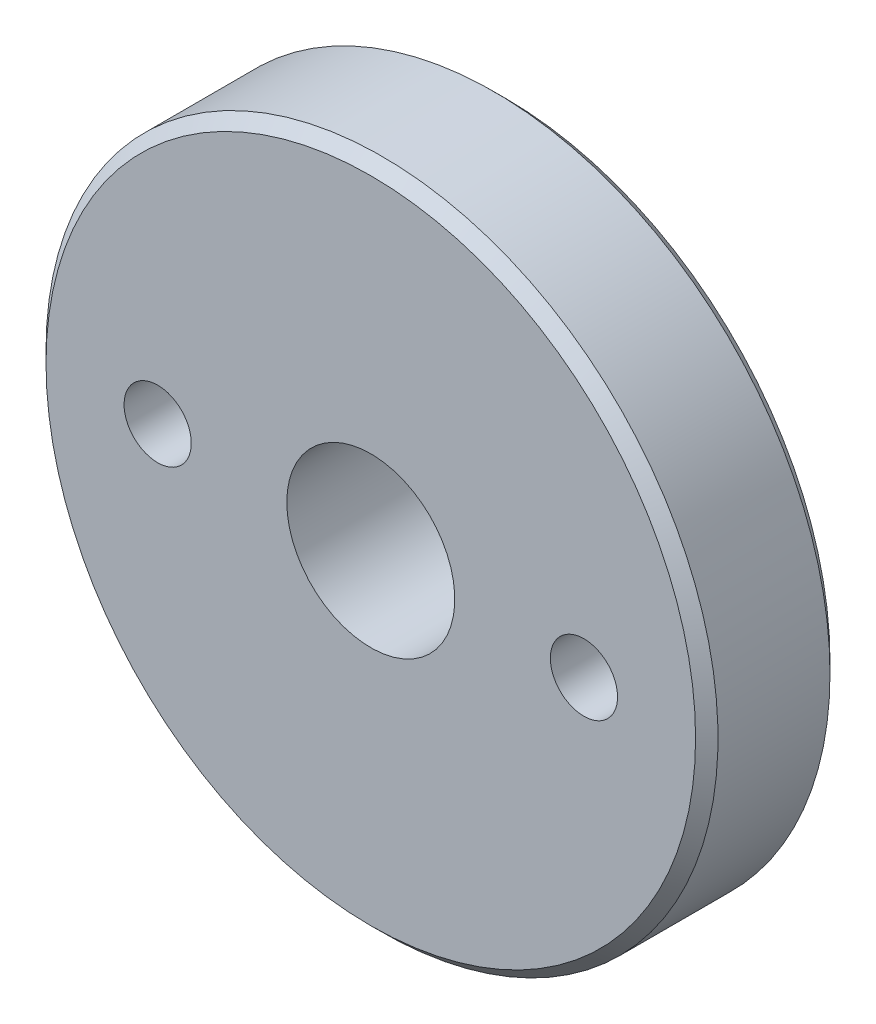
ISO-10303-21;
HEADER;
FILE_DESCRIPTION(('STEP AP214'),'2;1');
FILE_NAME('part.step','',(''),(''),'','','');
FILE_SCHEMA(('AUTOMOTIVE_DESIGN { 1 0 10303 214 1 1 1 1 }'));
ENDSEC;
DATA;
#1=APPLICATION_CONTEXT('core data for automotive mechanical design processes');
#2=APPLICATION_PROTOCOL_DEFINITION('international standard','automotive_design',2000,#1);
#3=PRODUCT_CONTEXT('',#1,'mechanical');
#4=PRODUCT('Part','Part','',(#3));
#5=PRODUCT_RELATED_PRODUCT_CATEGORY('part','',(#4));
#6=PRODUCT_DEFINITION_FORMATION('','',#4);
#7=PRODUCT_DEFINITION_CONTEXT('part definition',#1,'design');
#8=PRODUCT_DEFINITION('design','',#6,#7);
#9=PRODUCT_DEFINITION_SHAPE('','',#8);
#10=(LENGTH_UNIT() NAMED_UNIT(*) SI_UNIT(.MILLI.,.METRE.));
#11=(NAMED_UNIT(*) PLANE_ANGLE_UNIT() SI_UNIT($,.RADIAN.));
#12=(NAMED_UNIT(*) SI_UNIT($,.STERADIAN.) SOLID_ANGLE_UNIT());
#13=UNCERTAINTY_MEASURE_WITH_UNIT(LENGTH_MEASURE(1.E-05),#10,'distance_accuracy_value','');
#14=(GEOMETRIC_REPRESENTATION_CONTEXT(3) GLOBAL_UNCERTAINTY_ASSIGNED_CONTEXT((#13)) GLOBAL_UNIT_ASSIGNED_CONTEXT((#10,
#11,#12)) REPRESENTATION_CONTEXT('',''));
#15=CARTESIAN_POINT('',(0.,0.,0.));
#16=DIRECTION('',(0.,0.,1.));
#17=DIRECTION('',(1.,0.,0.));
#18=AXIS2_PLACEMENT_3D('',#15,#16,#17);
#19=CARTESIAN_POINT('',(0.,0.,19.3705627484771));
#20=DIRECTION('',(0.,0.,-1.));
#21=DIRECTION('',(-1.,0.,0.));
#22=AXIS2_PLACEMENT_3D('',#19,#20,#21);
#23=CYLINDRICAL_SURFACE('',#22,6.);
#24=CARTESIAN_POINT('',(0.,0.,2.2));
#25=DIRECTION('',(0.,0.,1.));
#26=DIRECTION('',(1.,0.,0.));
#27=AXIS2_PLACEMENT_3D('',#24,#25,#26);
#28=CIRCLE('',#27,6.);
#29=CARTESIAN_POINT('',(-6.,0.,2.2));
#30=VERTEX_POINT('',#29);
#31=EDGE_CURVE('E32',#30,#30,#28,.F.);
#32=CARTESIAN_POINT('',(0.,0.,0.199999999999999));
#33=DIRECTION('',(0.,0.,1.));
#34=DIRECTION('',(1.,0.,0.));
#35=AXIS2_PLACEMENT_3D('',#32,#33,#34);
#36=CIRCLE('',#35,6.);
#37=CARTESIAN_POINT('',(-6.,0.,0.199999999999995));
#38=VERTEX_POINT('',#37);
#39=EDGE_CURVE('E68',#38,#38,#36,.T.);
#40=CARTESIAN_POINT('',(-6.,0.,2.2));
#41=CARTESIAN_POINT('',(-6.,0.,2.17916666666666));
#42=CARTESIAN_POINT('',(-6.,0.,2.15833333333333));
#43=CARTESIAN_POINT('',(-6.,0.,2.11666666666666));
#44=CARTESIAN_POINT('',(-6.,0.,2.09583333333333));
#45=CARTESIAN_POINT('',(-6.,0.,2.05416666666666));
#46=CARTESIAN_POINT('',(-6.,0.,2.03333333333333));
#47=CARTESIAN_POINT('',(-6.,0.,1.99166666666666));
#48=CARTESIAN_POINT('',(-6.,0.,1.97083333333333));
#49=CARTESIAN_POINT('',(-6.,0.,1.92916666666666));
#50=CARTESIAN_POINT('',(-6.,0.,1.90833333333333));
#51=CARTESIAN_POINT('',(-6.,0.,1.86666666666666));
#52=CARTESIAN_POINT('',(-6.,0.,1.84583333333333));
#53=CARTESIAN_POINT('',(-6.,0.,1.80416666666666));
#54=CARTESIAN_POINT('',(-6.,0.,1.78333333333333));
#55=CARTESIAN_POINT('',(-6.,0.,1.74166666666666));
#56=CARTESIAN_POINT('',(-6.,0.,1.72083333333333));
#57=CARTESIAN_POINT('',(-6.,0.,1.67916666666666));
#58=CARTESIAN_POINT('',(-6.,0.,1.65833333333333));
#59=CARTESIAN_POINT('',(-6.,0.,1.61666666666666));
#60=CARTESIAN_POINT('',(-6.,0.,1.59583333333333));
#61=CARTESIAN_POINT('',(-6.,0.,1.55416666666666));
#62=CARTESIAN_POINT('',(-6.,0.,1.53333333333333));
#63=CARTESIAN_POINT('',(-6.,0.,1.49166666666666));
#64=CARTESIAN_POINT('',(-6.,0.,1.47083333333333));
#65=CARTESIAN_POINT('',(-6.,0.,1.42916666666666));
#66=CARTESIAN_POINT('',(-6.,0.,1.40833333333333));
#67=CARTESIAN_POINT('',(-6.,0.,1.36666666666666));
#68=CARTESIAN_POINT('',(-6.,0.,1.34583333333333));
#69=CARTESIAN_POINT('',(-6.,0.,1.30416666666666));
#70=CARTESIAN_POINT('',(-6.,0.,1.28333333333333));
#71=CARTESIAN_POINT('',(-6.,0.,1.24166666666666));
#72=CARTESIAN_POINT('',(-6.,0.,1.22083333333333));
#73=CARTESIAN_POINT('',(-6.,0.,1.17916666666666));
#74=CARTESIAN_POINT('',(-6.,0.,1.15833333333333));
#75=CARTESIAN_POINT('',(-6.,0.,1.11666666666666));
#76=CARTESIAN_POINT('',(-6.,0.,1.09583333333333));
#77=CARTESIAN_POINT('',(-6.,0.,1.05416666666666));
#78=CARTESIAN_POINT('',(-6.,0.,1.03333333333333));
#79=CARTESIAN_POINT('',(-6.,0.,0.991666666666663));
#80=CARTESIAN_POINT('',(-6.,0.,0.970833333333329));
#81=CARTESIAN_POINT('',(-6.,0.,0.929166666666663));
#82=CARTESIAN_POINT('',(-6.,0.,0.908333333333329));
#83=CARTESIAN_POINT('',(-6.,0.,0.866666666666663));
#84=CARTESIAN_POINT('',(-6.,0.,0.845833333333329));
#85=CARTESIAN_POINT('',(-6.,0.,0.804166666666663));
#86=CARTESIAN_POINT('',(-6.,0.,0.783333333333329));
#87=CARTESIAN_POINT('',(-6.,0.,0.741666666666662));
#88=CARTESIAN_POINT('',(-6.,0.,0.720833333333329));
#89=CARTESIAN_POINT('',(-6.,0.,0.679166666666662));
#90=CARTESIAN_POINT('',(-6.,0.,0.658333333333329));
#91=CARTESIAN_POINT('',(-6.,0.,0.616666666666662));
#92=CARTESIAN_POINT('',(-6.,0.,0.595833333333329));
#93=CARTESIAN_POINT('',(-6.,0.,0.554166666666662));
#94=CARTESIAN_POINT('',(-6.,0.,0.533333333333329));
#95=CARTESIAN_POINT('',(-6.,0.,0.491666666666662));
#96=CARTESIAN_POINT('',(-6.,0.,0.470833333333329));
#97=CARTESIAN_POINT('',(-6.,0.,0.429166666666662));
#98=CARTESIAN_POINT('',(-6.,0.,0.408333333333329));
#99=CARTESIAN_POINT('',(-6.,0.,0.366666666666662));
#100=CARTESIAN_POINT('',(-6.,0.,0.345833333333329));
#101=CARTESIAN_POINT('',(-6.,0.,0.304166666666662));
#102=CARTESIAN_POINT('',(-6.,0.,0.283333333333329));
#103=CARTESIAN_POINT('',(-6.,0.,0.241666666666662));
#104=CARTESIAN_POINT('',(-6.,0.,0.220833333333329));
#105=CARTESIAN_POINT('',(-6.,0.,0.199999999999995));
#106=B_SPLINE_CURVE_WITH_KNOTS('',3,(#40,#41,#42,#43,#44,#45,#46,#47,#48,#49,#50,#51,#52,#53,
#54,#55,#56,#57,#58,#59,#60,#61,#62,#63,#64,#65,#66,#67,#68,#69,#70,#71,#72,#73,#74,#75,#76,#77,
#78,#79,#80,#81,#82,#83,#84,#85,#86,#87,#88,#89,#90,#91,#92,#93,#94,#95,#96,#97,#98,#99,#100,
#101,#102,#103,#104,#105),.UNSPECIFIED.,.F.,.F.,(4,2,2,2,2,2,2,2,2,2,2,2,2,2,2,2,2,2,2,2,2,2,2,
2,2,2,2,2,2,2,2,2,4),(0.,0.0625000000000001,0.125,0.1875,0.25,0.3125,0.375,0.4375,0.5,0.5625,
0.625000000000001,0.687500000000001,0.750000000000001,0.812500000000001,0.875000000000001,
0.937500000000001,1.,1.0625,1.125,1.1875,1.25,1.3125,1.375,1.4375,1.5,1.5625,1.625,1.6875,1.75,
1.8125,1.875,1.9375,2.),.UNSPECIFIED.);
#107=EDGE_CURVE('BSEAM25',#30,#38,#106,.T.);
#108=ORIENTED_EDGE('',*,*,#31,.T.);
#109=ORIENTED_EDGE('',*,*,#39,.T.);
#110=ORIENTED_EDGE('',*,*,#107,.T.);
#111=ORIENTED_EDGE('',*,*,#107,.F.);
#112=EDGE_LOOP('',(#108,#110,#109,#111));
#113=FACE_BOUND('',#112,.T.);
#114=ADVANCED_FACE('F25',(#113),#23,.T.);
#115=CARTESIAN_POINT('',(0.,0.,0.));
#116=DIRECTION('',(0.,0.,1.));
#117=DIRECTION('',(1.,0.,0.));
#118=AXIS2_PLACEMENT_3D('',#115,#116,#117);
#119=PLANE('',#118);
#120=CARTESIAN_POINT('',(0.,0.,0.));
#121=DIRECTION('',(0.,0.,1.));
#122=DIRECTION('',(1.,0.,0.));
#123=AXIS2_PLACEMENT_3D('',#120,#121,#122);
#124=CIRCLE('',#123,5.8);
#125=CARTESIAN_POINT('',(5.8,0.,0.));
#126=VERTEX_POINT('',#125);
#127=EDGE_CURVE('E11',#126,#126,#124,.F.);
#128=ORIENTED_EDGE('',*,*,#127,.T.);
#129=EDGE_LOOP('',(#128));
#130=FACE_BOUND('',#129,.T.);
#131=CARTESIAN_POINT('',(0.,0.,0.));
#132=DIRECTION('',(0.,0.,1.));
#133=DIRECTION('',(1.,0.,0.));
#134=AXIS2_PLACEMENT_3D('',#131,#132,#133);
#135=CIRCLE('',#134,1.5);
#136=CARTESIAN_POINT('',(-1.5,0.,0.));
#137=VERTEX_POINT('',#136);
#138=EDGE_CURVE('E60',#137,#137,#135,.T.);
#139=ORIENTED_EDGE('',*,*,#138,.T.);
#140=EDGE_LOOP('',(#139));
#141=FACE_BOUND('',#140,.T.);
#142=ADVANCED_FACE('F94',(#130,#141),#119,.F.);
#143=CARTESIAN_POINT('',(0.,0.,19.3705627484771));
#144=DIRECTION('',(0.,0.,-1.));
#145=DIRECTION('',(-1.,0.,0.));
#146=AXIS2_PLACEMENT_3D('',#143,#144,#145);
#147=CYLINDRICAL_SURFACE('',#146,1.5);
#148=CARTESIAN_POINT('',(0.,0.,2.4));
#149=DIRECTION('',(0.,0.,1.));
#150=DIRECTION('',(1.,0.,0.));
#151=AXIS2_PLACEMENT_3D('',#148,#149,#150);
#152=CIRCLE('',#151,1.5);
#153=CARTESIAN_POINT('',(-1.5,0.,2.4));
#154=VERTEX_POINT('',#153);
#155=EDGE_CURVE('E59',#154,#154,#152,.T.);
#156=CARTESIAN_POINT('',(-1.5,0.,0.));
#157=CARTESIAN_POINT('',(-1.5,0.,0.0249999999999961));
#158=CARTESIAN_POINT('',(-1.5,0.,0.0499999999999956));
#159=CARTESIAN_POINT('',(-1.5,0.,0.0999999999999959));
#160=CARTESIAN_POINT('',(-1.5,0.,0.124999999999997));
#161=CARTESIAN_POINT('',(-1.5,0.,0.174999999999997));
#162=CARTESIAN_POINT('',(-1.5,0.,0.199999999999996));
#163=CARTESIAN_POINT('',(-1.5,0.,0.249999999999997));
#164=CARTESIAN_POINT('',(-1.5,0.,0.274999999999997));
#165=CARTESIAN_POINT('',(-1.5,0.,0.324999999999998));
#166=CARTESIAN_POINT('',(-1.5,0.,0.349999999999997));
#167=CARTESIAN_POINT('',(-1.5,0.,0.399999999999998));
#168=CARTESIAN_POINT('',(-1.5,0.,0.424999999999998));
#169=CARTESIAN_POINT('',(-1.5,0.,0.474999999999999));
#170=CARTESIAN_POINT('',(-1.5,0.,0.499999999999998));
#171=CARTESIAN_POINT('',(-1.5,0.,0.549999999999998));
#172=CARTESIAN_POINT('',(-1.5,0.,0.574999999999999));
#173=CARTESIAN_POINT('',(-1.5,0.,0.624999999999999));
#174=CARTESIAN_POINT('',(-1.5,0.,0.649999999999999));
#175=CARTESIAN_POINT('',(-1.5,0.,0.699999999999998));
#176=CARTESIAN_POINT('',(-1.5,0.,0.724999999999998));
#177=CARTESIAN_POINT('',(-1.5,0.,0.774999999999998));
#178=CARTESIAN_POINT('',(-1.5,0.,0.799999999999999));
#179=CARTESIAN_POINT('',(-1.5,0.,0.849999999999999));
#180=CARTESIAN_POINT('',(-1.5,0.,0.874999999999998));
#181=CARTESIAN_POINT('',(-1.5,0.,0.924999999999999));
#182=CARTESIAN_POINT('',(-1.5,0.,0.95));
#183=CARTESIAN_POINT('',(-1.5,0.,1.));
#184=CARTESIAN_POINT('',(-1.5,0.,1.025));
#185=CARTESIAN_POINT('',(-1.5,0.,1.075));
#186=CARTESIAN_POINT('',(-1.5,0.,1.1));
#187=CARTESIAN_POINT('',(-1.5,0.,1.15));
#188=CARTESIAN_POINT('',(-1.5,0.,1.175));
#189=CARTESIAN_POINT('',(-1.5,0.,1.225));
#190=CARTESIAN_POINT('',(-1.5,0.,1.25));
#191=CARTESIAN_POINT('',(-1.5,0.,1.3));
#192=CARTESIAN_POINT('',(-1.5,0.,1.325));
#193=CARTESIAN_POINT('',(-1.5,0.,1.375));
#194=CARTESIAN_POINT('',(-1.5,0.,1.4));
#195=CARTESIAN_POINT('',(-1.5,0.,1.45));
#196=CARTESIAN_POINT('',(-1.5,0.,1.475));
#197=CARTESIAN_POINT('',(-1.5,0.,1.525));
#198=CARTESIAN_POINT('',(-1.5,0.,1.55));
#199=CARTESIAN_POINT('',(-1.5,0.,1.6));
#200=CARTESIAN_POINT('',(-1.5,0.,1.625));
#201=CARTESIAN_POINT('',(-1.5,0.,1.675));
#202=CARTESIAN_POINT('',(-1.5,0.,1.7));
#203=CARTESIAN_POINT('',(-1.5,0.,1.75));
#204=CARTESIAN_POINT('',(-1.5,0.,1.775));
#205=CARTESIAN_POINT('',(-1.5,0.,1.825));
#206=CARTESIAN_POINT('',(-1.5,0.,1.85));
#207=CARTESIAN_POINT('',(-1.5,0.,1.9));
#208=CARTESIAN_POINT('',(-1.5,0.,1.925));
#209=CARTESIAN_POINT('',(-1.5,0.,1.975));
#210=CARTESIAN_POINT('',(-1.5,0.,2.));
#211=CARTESIAN_POINT('',(-1.5,0.,2.05));
#212=CARTESIAN_POINT('',(-1.5,0.,2.075));
#213=CARTESIAN_POINT('',(-1.5,0.,2.125));
#214=CARTESIAN_POINT('',(-1.5,0.,2.15));
#215=CARTESIAN_POINT('',(-1.5,0.,2.2));
#216=CARTESIAN_POINT('',(-1.5,0.,2.225));
#217=CARTESIAN_POINT('',(-1.5,0.,2.275));
#218=CARTESIAN_POINT('',(-1.5,0.,2.3));
#219=CARTESIAN_POINT('',(-1.5,0.,2.35));
#220=CARTESIAN_POINT('',(-1.5,0.,2.375));
#221=CARTESIAN_POINT('',(-1.5,0.,2.4));
#222=B_SPLINE_CURVE_WITH_KNOTS('',3,(#156,#157,#158,#159,#160,#161,#162,#163,#164,#165,#166,
#167,#168,#169,#170,#171,#172,#173,#174,#175,#176,#177,#178,#179,#180,#181,#182,#183,#184,#185,
#186,#187,#188,#189,#190,#191,#192,#193,#194,#195,#196,#197,#198,#199,#200,#201,#202,#203,#204,
#205,#206,#207,#208,#209,#210,#211,#212,#213,#214,#215,#216,#217,#218,#219,#220,#221),
.UNSPECIFIED.,.F.,.F.,(4,2,2,2,2,2,2,2,2,2,2,2,2,2,2,2,2,2,2,2,2,2,2,2,2,2,2,2,2,2,2,2,4),(0.,
0.0749999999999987,0.150000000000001,0.225,0.300000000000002,0.375,0.450000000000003,
0.525000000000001,0.600000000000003,0.675000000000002,0.750000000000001,0.825000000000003,
0.900000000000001,0.975000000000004,1.05,1.125,1.2,1.275,1.35,1.425,1.5,1.575,1.65000000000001,
1.725,1.8,1.87500000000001,1.95,2.02500000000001,2.1,2.17500000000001,2.25000000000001,
2.32500000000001,2.40000000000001),.UNSPECIFIED.);
#223=EDGE_CURVE('BSEAM85',#137,#154,#222,.T.);
#224=ORIENTED_EDGE('',*,*,#138,.F.);
#225=ORIENTED_EDGE('',*,*,#155,.T.);
#226=ORIENTED_EDGE('',*,*,#223,.T.);
#227=ORIENTED_EDGE('',*,*,#223,.F.);
#228=EDGE_LOOP('',(#224,#226,#225,#227));
#229=FACE_BOUND('',#228,.T.);
#230=ADVANCED_FACE('F85',(#229),#147,.F.);
#231=CARTESIAN_POINT('',(4.83824408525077,4.34066747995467,2.4));
#232=DIRECTION('',(0.,0.,1.));
#233=DIRECTION('',(0.744345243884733,0.667794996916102,0.));
#234=AXIS2_PLACEMENT_3D('',#231,#232,#233);
#235=PLANE('',#234);
#236=CARTESIAN_POINT('',(0.,0.,2.4));
#237=DIRECTION('',(0.,0.,1.));
#238=DIRECTION('',(1.,0.,0.));
#239=AXIS2_PLACEMENT_3D('',#236,#237,#238);
#240=CIRCLE('',#239,5.8);
#241=CARTESIAN_POINT('',(-5.8,0.,2.4));
#242=VERTEX_POINT('',#241);
#243=EDGE_CURVE('E63',#242,#242,#240,.T.);
#244=ORIENTED_EDGE('',*,*,#243,.T.);
#245=EDGE_LOOP('',(#244));
#246=FACE_BOUND('',#245,.T.);
#247=CARTESIAN_POINT('',(3.80613418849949,-0.0578146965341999,2.4));
#248=DIRECTION('',(0.,0.,1.));
#249=DIRECTION('',(0.,-1.,0.));
#250=AXIS2_PLACEMENT_3D('',#247,#248,#249);
#251=CIRCLE('',#250,0.599999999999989);
#252=CARTESIAN_POINT('',(3.80613418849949,-0.657814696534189,2.4));
#253=VERTEX_POINT('',#252);
#254=EDGE_CURVE('E48',#253,#253,#251,.T.);
#255=ORIENTED_EDGE('',*,*,#254,.F.);
#256=EDGE_LOOP('',(#255));
#257=FACE_BOUND('',#256,.T.);
#258=CARTESIAN_POINT('',(-3.80613418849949,0.0578146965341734,2.4));
#259=DIRECTION('',(0.,0.,1.));
#260=DIRECTION('',(0.,-1.,0.));
#261=AXIS2_PLACEMENT_3D('',#258,#259,#260);
#262=CIRCLE('',#261,0.599999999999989);
#263=CARTESIAN_POINT('',(-3.80613418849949,-0.542185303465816,2.4));
#264=VERTEX_POINT('',#263);
#265=EDGE_CURVE('E56',#264,#264,#262,.T.);
#266=ORIENTED_EDGE('',*,*,#265,.F.);
#267=EDGE_LOOP('',(#266));
#268=FACE_BOUND('',#267,.T.);
#269=ORIENTED_EDGE('',*,*,#155,.F.);
#270=EDGE_LOOP('',(#269));
#271=FACE_BOUND('',#270,.T.);
#272=ADVANCED_FACE('F81',(#246,#257,#268,#271),#235,.T.);
#273=CARTESIAN_POINT('',(-3.80613418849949,0.0578146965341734,2.4));
#274=DIRECTION('',(0.,0.,1.));
#275=DIRECTION('',(0.,-1.,0.));
#276=AXIS2_PLACEMENT_3D('',#273,#274,#275);
#277=CYLINDRICAL_SURFACE('',#276,0.599999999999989);
#278=CARTESIAN_POINT('',(-3.80613418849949,0.0578146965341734,1.4));
#279=DIRECTION('',(0.,0.,1.));
#280=DIRECTION('',(0.,-1.,0.));
#281=AXIS2_PLACEMENT_3D('',#278,#279,#280);
#282=CIRCLE('',#281,0.599999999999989);
#283=CARTESIAN_POINT('',(-3.80613418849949,-0.542185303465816,1.4));
#284=VERTEX_POINT('',#283);
#285=EDGE_CURVE('E51',#284,#284,#282,.T.);
#286=CARTESIAN_POINT('',(-3.80613418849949,-0.542185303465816,1.4));
#287=CARTESIAN_POINT('',(-3.80613418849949,-0.542185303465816,1.41041666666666));
#288=CARTESIAN_POINT('',(-3.80613418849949,-0.542185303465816,1.42083333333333));
#289=CARTESIAN_POINT('',(-3.80613418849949,-0.542185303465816,1.44166666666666));
#290=CARTESIAN_POINT('',(-3.80613418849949,-0.542185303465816,1.45208333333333));
#291=CARTESIAN_POINT('',(-3.80613418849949,-0.542185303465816,1.47291666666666));
#292=CARTESIAN_POINT('',(-3.80613418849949,-0.542185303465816,1.48333333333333));
#293=CARTESIAN_POINT('',(-3.80613418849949,-0.542185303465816,1.50416666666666));
#294=CARTESIAN_POINT('',(-3.80613418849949,-0.542185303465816,1.51458333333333));
#295=CARTESIAN_POINT('',(-3.80613418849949,-0.542185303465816,1.53541666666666));
#296=CARTESIAN_POINT('',(-3.80613418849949,-0.542185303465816,1.54583333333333));
#297=CARTESIAN_POINT('',(-3.80613418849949,-0.542185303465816,1.56666666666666));
#298=CARTESIAN_POINT('',(-3.80613418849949,-0.542185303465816,1.57708333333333));
#299=CARTESIAN_POINT('',(-3.80613418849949,-0.542185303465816,1.59791666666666));
#300=CARTESIAN_POINT('',(-3.80613418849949,-0.542185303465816,1.60833333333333));
#301=CARTESIAN_POINT('',(-3.80613418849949,-0.542185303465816,1.62916666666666));
#302=CARTESIAN_POINT('',(-3.80613418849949,-0.542185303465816,1.63958333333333));
#303=CARTESIAN_POINT('',(-3.80613418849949,-0.542185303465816,1.66041666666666));
#304=CARTESIAN_POINT('',(-3.80613418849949,-0.542185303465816,1.67083333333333));
#305=CARTESIAN_POINT('',(-3.80613418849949,-0.542185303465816,1.69166666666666));
#306=CARTESIAN_POINT('',(-3.80613418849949,-0.542185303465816,1.70208333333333));
#307=CARTESIAN_POINT('',(-3.80613418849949,-0.542185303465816,1.72291666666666));
#308=CARTESIAN_POINT('',(-3.80613418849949,-0.542185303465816,1.73333333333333));
#309=CARTESIAN_POINT('',(-3.80613418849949,-0.542185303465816,1.75416666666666));
#310=CARTESIAN_POINT('',(-3.80613418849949,-0.542185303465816,1.76458333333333));
#311=CARTESIAN_POINT('',(-3.80613418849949,-0.542185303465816,1.78541666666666));
#312=CARTESIAN_POINT('',(-3.80613418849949,-0.542185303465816,1.79583333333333));
#313=CARTESIAN_POINT('',(-3.80613418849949,-0.542185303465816,1.81666666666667));
#314=CARTESIAN_POINT('',(-3.80613418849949,-0.542185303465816,1.82708333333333));
#315=CARTESIAN_POINT('',(-3.80613418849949,-0.542185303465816,1.84791666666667));
#316=CARTESIAN_POINT('',(-3.80613418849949,-0.542185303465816,1.85833333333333));
#317=CARTESIAN_POINT('',(-3.80613418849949,-0.542185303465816,1.87916666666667));
#318=CARTESIAN_POINT('',(-3.80613418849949,-0.542185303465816,1.88958333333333));
#319=CARTESIAN_POINT('',(-3.80613418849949,-0.542185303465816,1.91041666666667));
#320=CARTESIAN_POINT('',(-3.80613418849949,-0.542185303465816,1.92083333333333));
#321=CARTESIAN_POINT('',(-3.80613418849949,-0.542185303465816,1.94166666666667));
#322=CARTESIAN_POINT('',(-3.80613418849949,-0.542185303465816,1.95208333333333));
#323=CARTESIAN_POINT('',(-3.80613418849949,-0.542185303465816,1.97291666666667));
#324=CARTESIAN_POINT('',(-3.80613418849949,-0.542185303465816,1.98333333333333));
#325=CARTESIAN_POINT('',(-3.80613418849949,-0.542185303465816,2.00416666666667));
#326=CARTESIAN_POINT('',(-3.80613418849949,-0.542185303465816,2.01458333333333));
#327=CARTESIAN_POINT('',(-3.80613418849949,-0.542185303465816,2.03541666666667));
#328=CARTESIAN_POINT('',(-3.80613418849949,-0.542185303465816,2.04583333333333));
#329=CARTESIAN_POINT('',(-3.80613418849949,-0.542185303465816,2.06666666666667));
#330=CARTESIAN_POINT('',(-3.80613418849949,-0.542185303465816,2.07708333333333));
#331=CARTESIAN_POINT('',(-3.80613418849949,-0.542185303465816,2.09791666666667));
#332=CARTESIAN_POINT('',(-3.80613418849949,-0.542185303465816,2.10833333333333));
#333=CARTESIAN_POINT('',(-3.80613418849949,-0.542185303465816,2.12916666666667));
#334=CARTESIAN_POINT('',(-3.80613418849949,-0.542185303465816,2.13958333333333));
#335=CARTESIAN_POINT('',(-3.80613418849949,-0.542185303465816,2.16041666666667));
#336=CARTESIAN_POINT('',(-3.80613418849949,-0.542185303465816,2.17083333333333));
#337=CARTESIAN_POINT('',(-3.80613418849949,-0.542185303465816,2.19166666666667));
#338=CARTESIAN_POINT('',(-3.80613418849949,-0.542185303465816,2.20208333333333));
#339=CARTESIAN_POINT('',(-3.80613418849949,-0.542185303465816,2.22291666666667));
#340=CARTESIAN_POINT('',(-3.80613418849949,-0.542185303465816,2.23333333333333));
#341=CARTESIAN_POINT('',(-3.80613418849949,-0.542185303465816,2.25416666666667));
#342=CARTESIAN_POINT('',(-3.80613418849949,-0.542185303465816,2.26458333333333));
#343=CARTESIAN_POINT('',(-3.80613418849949,-0.542185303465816,2.28541666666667));
#344=CARTESIAN_POINT('',(-3.80613418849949,-0.542185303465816,2.29583333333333));
#345=CARTESIAN_POINT('',(-3.80613418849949,-0.542185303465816,2.31666666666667));
#346=CARTESIAN_POINT('',(-3.80613418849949,-0.542185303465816,2.32708333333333));
#347=CARTESIAN_POINT('',(-3.80613418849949,-0.542185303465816,2.34791666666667));
#348=CARTESIAN_POINT('',(-3.80613418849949,-0.542185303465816,2.35833333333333));
#349=CARTESIAN_POINT('',(-3.80613418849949,-0.542185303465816,2.37916666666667));
#350=CARTESIAN_POINT('',(-3.80613418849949,-0.542185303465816,2.38958333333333));
#351=CARTESIAN_POINT('',(-3.80613418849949,-0.542185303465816,2.4));
#352=B_SPLINE_CURVE_WITH_KNOTS('',3,(#286,#287,#288,#289,#290,#291,#292,#293,#294,#295,#296,
#297,#298,#299,#300,#301,#302,#303,#304,#305,#306,#307,#308,#309,#310,#311,#312,#313,#314,#315,
#316,#317,#318,#319,#320,#321,#322,#323,#324,#325,#326,#327,#328,#329,#330,#331,#332,#333,#334,
#335,#336,#337,#338,#339,#340,#341,#342,#343,#344,#345,#346,#347,#348,#349,#350,#351),
.UNSPECIFIED.,.F.,.F.,(4,2,2,2,2,2,2,2,2,2,2,2,2,2,2,2,2,2,2,2,2,2,2,2,2,2,2,2,2,2,2,2,4),(0.,
0.03125,0.0625000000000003,0.0937500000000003,0.125,0.15625,0.1875,0.21875,0.25,0.28125,0.3125,
0.34375,0.375000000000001,0.406250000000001,0.437500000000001,0.468750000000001,
0.500000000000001,0.531250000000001,0.562500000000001,0.593750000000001,0.625000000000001,
0.656250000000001,0.687500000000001,0.718750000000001,0.750000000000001,0.781250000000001,
0.812500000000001,0.843750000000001,0.875000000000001,0.906250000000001,0.937500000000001,
0.968750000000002,1.),.UNSPECIFIED.);
#353=EDGE_CURVE('BSEAM84',#284,#264,#352,.T.);
#354=ORIENTED_EDGE('',*,*,#285,.F.);
#355=ORIENTED_EDGE('',*,*,#265,.T.);
#356=ORIENTED_EDGE('',*,*,#353,.T.);
#357=ORIENTED_EDGE('',*,*,#353,.F.);
#358=EDGE_LOOP('',(#354,#356,#355,#357));
#359=FACE_BOUND('',#358,.T.);
#360=ADVANCED_FACE('F84',(#359),#277,.F.);
#361=CARTESIAN_POINT('',(-3.80613418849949,0.0578146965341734,1.4));
#362=DIRECTION('',(0.,0.,1.));
#363=DIRECTION('',(0.,-1.,0.));
#364=AXIS2_PLACEMENT_3D('',#361,#362,#363);
#365=CONICAL_SURFACE('',#364,0.599999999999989,1.02974425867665);
#366=CARTESIAN_POINT('',(-3.80613418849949,0.0578146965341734,1.03948362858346));
#367=VERTEX_POINT('',#366);
#368=VERTEX_LOOP('',#367);
#369=FACE_BOUND('',#368,.T.);
#370=ORIENTED_EDGE('',*,*,#285,.T.);
#371=EDGE_LOOP('',(#370));
#372=FACE_BOUND('',#371,.T.);
#373=ADVANCED_FACE('F110',(#369,#372),#365,.F.);
#374=CARTESIAN_POINT('',(3.80613418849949,-0.0578146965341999,2.4));
#375=DIRECTION('',(0.,0.,1.));
#376=DIRECTION('',(0.,-1.,0.));
#377=AXIS2_PLACEMENT_3D('',#374,#375,#376);
#378=CYLINDRICAL_SURFACE('',#377,0.599999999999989);
#379=CARTESIAN_POINT('',(3.80613418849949,-0.0578146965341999,1.4));
#380=DIRECTION('',(0.,0.,1.));
#381=DIRECTION('',(0.,-1.,0.));
#382=AXIS2_PLACEMENT_3D('',#379,#380,#381);
#383=CIRCLE('',#382,0.599999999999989);
#384=CARTESIAN_POINT('',(3.80613418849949,-0.657814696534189,1.4));
#385=VERTEX_POINT('',#384);
#386=EDGE_CURVE('E46',#385,#385,#383,.T.);
#387=CARTESIAN_POINT('',(3.80613418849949,-0.657814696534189,1.4));
#388=CARTESIAN_POINT('',(3.80613418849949,-0.657814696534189,1.41041666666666));
#389=CARTESIAN_POINT('',(3.80613418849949,-0.657814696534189,1.42083333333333));
#390=CARTESIAN_POINT('',(3.80613418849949,-0.657814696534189,1.44166666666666));
#391=CARTESIAN_POINT('',(3.80613418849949,-0.657814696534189,1.45208333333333));
#392=CARTESIAN_POINT('',(3.80613418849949,-0.657814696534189,1.47291666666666));
#393=CARTESIAN_POINT('',(3.80613418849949,-0.657814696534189,1.48333333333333));
#394=CARTESIAN_POINT('',(3.80613418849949,-0.657814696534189,1.50416666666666));
#395=CARTESIAN_POINT('',(3.80613418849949,-0.657814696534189,1.51458333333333));
#396=CARTESIAN_POINT('',(3.80613418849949,-0.657814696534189,1.53541666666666));
#397=CARTESIAN_POINT('',(3.80613418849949,-0.657814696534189,1.54583333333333));
#398=CARTESIAN_POINT('',(3.80613418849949,-0.657814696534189,1.56666666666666));
#399=CARTESIAN_POINT('',(3.80613418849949,-0.657814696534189,1.57708333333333));
#400=CARTESIAN_POINT('',(3.80613418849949,-0.657814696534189,1.59791666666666));
#401=CARTESIAN_POINT('',(3.80613418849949,-0.657814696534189,1.60833333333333));
#402=CARTESIAN_POINT('',(3.80613418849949,-0.657814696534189,1.62916666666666));
#403=CARTESIAN_POINT('',(3.80613418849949,-0.657814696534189,1.63958333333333));
#404=CARTESIAN_POINT('',(3.80613418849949,-0.657814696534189,1.66041666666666));
#405=CARTESIAN_POINT('',(3.80613418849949,-0.657814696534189,1.67083333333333));
#406=CARTESIAN_POINT('',(3.80613418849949,-0.657814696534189,1.69166666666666));
#407=CARTESIAN_POINT('',(3.80613418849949,-0.657814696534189,1.70208333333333));
#408=CARTESIAN_POINT('',(3.80613418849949,-0.657814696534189,1.72291666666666));
#409=CARTESIAN_POINT('',(3.80613418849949,-0.657814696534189,1.73333333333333));
#410=CARTESIAN_POINT('',(3.80613418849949,-0.657814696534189,1.75416666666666));
#411=CARTESIAN_POINT('',(3.80613418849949,-0.657814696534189,1.76458333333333));
#412=CARTESIAN_POINT('',(3.80613418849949,-0.657814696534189,1.78541666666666));
#413=CARTESIAN_POINT('',(3.80613418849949,-0.657814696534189,1.79583333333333));
#414=CARTESIAN_POINT('',(3.80613418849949,-0.657814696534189,1.81666666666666));
#415=CARTESIAN_POINT('',(3.80613418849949,-0.657814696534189,1.82708333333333));
#416=CARTESIAN_POINT('',(3.80613418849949,-0.657814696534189,1.84791666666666));
#417=CARTESIAN_POINT('',(3.80613418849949,-0.657814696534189,1.85833333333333));
#418=CARTESIAN_POINT('',(3.80613418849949,-0.657814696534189,1.87916666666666));
#419=CARTESIAN_POINT('',(3.80613418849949,-0.657814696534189,1.88958333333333));
#420=CARTESIAN_POINT('',(3.80613418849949,-0.657814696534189,1.91041666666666));
#421=CARTESIAN_POINT('',(3.80613418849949,-0.657814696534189,1.92083333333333));
#422=CARTESIAN_POINT('',(3.80613418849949,-0.657814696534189,1.94166666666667));
#423=CARTESIAN_POINT('',(3.80613418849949,-0.657814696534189,1.95208333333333));
#424=CARTESIAN_POINT('',(3.80613418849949,-0.657814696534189,1.97291666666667));
#425=CARTESIAN_POINT('',(3.80613418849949,-0.657814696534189,1.98333333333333));
#426=CARTESIAN_POINT('',(3.80613418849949,-0.657814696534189,2.00416666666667));
#427=CARTESIAN_POINT('',(3.80613418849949,-0.657814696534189,2.01458333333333));
#428=CARTESIAN_POINT('',(3.80613418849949,-0.657814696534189,2.03541666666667));
#429=CARTESIAN_POINT('',(3.80613418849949,-0.657814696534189,2.04583333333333));
#430=CARTESIAN_POINT('',(3.80613418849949,-0.657814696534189,2.06666666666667));
#431=CARTESIAN_POINT('',(3.80613418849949,-0.657814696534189,2.07708333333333));
#432=CARTESIAN_POINT('',(3.80613418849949,-0.657814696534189,2.09791666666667));
#433=CARTESIAN_POINT('',(3.80613418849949,-0.657814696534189,2.10833333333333));
#434=CARTESIAN_POINT('',(3.80613418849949,-0.657814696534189,2.12916666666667));
#435=CARTESIAN_POINT('',(3.80613418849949,-0.657814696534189,2.13958333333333));
#436=CARTESIAN_POINT('',(3.80613418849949,-0.657814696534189,2.16041666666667));
#437=CARTESIAN_POINT('',(3.80613418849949,-0.657814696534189,2.17083333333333));
#438=CARTESIAN_POINT('',(3.80613418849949,-0.657814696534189,2.19166666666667));
#439=CARTESIAN_POINT('',(3.80613418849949,-0.657814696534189,2.20208333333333));
#440=CARTESIAN_POINT('',(3.80613418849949,-0.657814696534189,2.22291666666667));
#441=CARTESIAN_POINT('',(3.80613418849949,-0.657814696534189,2.23333333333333));
#442=CARTESIAN_POINT('',(3.80613418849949,-0.657814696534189,2.25416666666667));
#443=CARTESIAN_POINT('',(3.80613418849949,-0.657814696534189,2.26458333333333));
#444=CARTESIAN_POINT('',(3.80613418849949,-0.657814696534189,2.28541666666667));
#445=CARTESIAN_POINT('',(3.80613418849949,-0.657814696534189,2.29583333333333));
#446=CARTESIAN_POINT('',(3.80613418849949,-0.657814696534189,2.31666666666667));
#447=CARTESIAN_POINT('',(3.80613418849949,-0.657814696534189,2.32708333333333));
#448=CARTESIAN_POINT('',(3.80613418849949,-0.657814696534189,2.34791666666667));
#449=CARTESIAN_POINT('',(3.80613418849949,-0.657814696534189,2.35833333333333));
#450=CARTESIAN_POINT('',(3.80613418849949,-0.657814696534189,2.37916666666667));
#451=CARTESIAN_POINT('',(3.80613418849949,-0.657814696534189,2.38958333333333));
#452=CARTESIAN_POINT('',(3.80613418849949,-0.657814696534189,2.4));
#453=B_SPLINE_CURVE_WITH_KNOTS('',3,(#387,#388,#389,#390,#391,#392,#393,#394,#395,#396,#397,
#398,#399,#400,#401,#402,#403,#404,#405,#406,#407,#408,#409,#410,#411,#412,#413,#414,#415,#416,
#417,#418,#419,#420,#421,#422,#423,#424,#425,#426,#427,#428,#429,#430,#431,#432,#433,#434,#435,
#436,#437,#438,#439,#440,#441,#442,#443,#444,#445,#446,#447,#448,#449,#450,#451,#452),
.UNSPECIFIED.,.F.,.F.,(4,2,2,2,2,2,2,2,2,2,2,2,2,2,2,2,2,2,2,2,2,2,2,2,2,2,2,2,2,2,2,2,4),(0.,
0.03125,0.0625000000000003,0.0937500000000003,0.125,0.15625,0.1875,0.21875,0.25,0.28125,0.3125,
0.34375,0.375000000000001,0.406250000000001,0.437500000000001,0.468750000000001,
0.500000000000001,0.531250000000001,0.562500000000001,0.593750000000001,0.625000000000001,
0.656250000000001,0.687500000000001,0.718750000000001,0.750000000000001,0.781250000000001,
0.812500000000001,0.843750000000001,0.875000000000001,0.906250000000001,0.937500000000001,
0.968750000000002,1.),.UNSPECIFIED.);
#454=EDGE_CURVE('BSEAM42',#385,#253,#453,.T.);
#455=ORIENTED_EDGE('',*,*,#386,.F.);
#456=ORIENTED_EDGE('',*,*,#254,.T.);
#457=ORIENTED_EDGE('',*,*,#454,.T.);
#458=ORIENTED_EDGE('',*,*,#454,.F.);
#459=EDGE_LOOP('',(#455,#457,#456,#458));
#460=FACE_BOUND('',#459,.T.);
#461=ADVANCED_FACE('F42',(#460),#378,.F.);
#462=CARTESIAN_POINT('',(3.80613418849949,-0.0578146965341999,1.4));
#463=DIRECTION('',(0.,0.,1.));
#464=DIRECTION('',(0.,-1.,0.));
#465=AXIS2_PLACEMENT_3D('',#462,#463,#464);
#466=CONICAL_SURFACE('',#465,0.599999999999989,1.02974425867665);
#467=CARTESIAN_POINT('',(3.80613418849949,-0.0578146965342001,1.03948362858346));
#468=VERTEX_POINT('',#467);
#469=VERTEX_LOOP('',#468);
#470=FACE_BOUND('',#469,.T.);
#471=ORIENTED_EDGE('',*,*,#386,.T.);
#472=EDGE_LOOP('',(#471));
#473=FACE_BOUND('',#472,.T.);
#474=ADVANCED_FACE('F38',(#470,#473),#466,.F.);
#475=CARTESIAN_POINT('',(0.,0.,2.4));
#476=DIRECTION('',(0.,0.,-1.));
#477=DIRECTION('',(-1.,0.,0.));
#478=AXIS2_PLACEMENT_3D('',#475,#476,#477);
#479=CONICAL_SURFACE('',#478,5.8,0.78539816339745);
#480=CARTESIAN_POINT('',(-6.,0.,2.2));
#481=CARTESIAN_POINT('',(-5.99791666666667,0.,2.20208333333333));
#482=CARTESIAN_POINT('',(-5.99583333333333,0.,2.20416666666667));
#483=CARTESIAN_POINT('',(-5.99166666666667,0.,2.20833333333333));
#484=CARTESIAN_POINT('',(-5.98958333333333,0.,2.21041666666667));
#485=CARTESIAN_POINT('',(-5.98541666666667,0.,2.21458333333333));
#486=CARTESIAN_POINT('',(-5.98333333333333,0.,2.21666666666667));
#487=CARTESIAN_POINT('',(-5.97916666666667,0.,2.22083333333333));
#488=CARTESIAN_POINT('',(-5.97708333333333,0.,2.22291666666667));
#489=CARTESIAN_POINT('',(-5.97291666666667,0.,2.22708333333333));
#490=CARTESIAN_POINT('',(-5.97083333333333,0.,2.22916666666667));
#491=CARTESIAN_POINT('',(-5.96666666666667,0.,2.23333333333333));
#492=CARTESIAN_POINT('',(-5.96458333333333,0.,2.23541666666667));
#493=CARTESIAN_POINT('',(-5.96041666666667,0.,2.23958333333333));
#494=CARTESIAN_POINT('',(-5.95833333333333,0.,2.24166666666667));
#495=CARTESIAN_POINT('',(-5.95416666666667,0.,2.24583333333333));
#496=CARTESIAN_POINT('',(-5.95208333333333,0.,2.24791666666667));
#497=CARTESIAN_POINT('',(-5.94791666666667,0.,2.25208333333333));
#498=CARTESIAN_POINT('',(-5.94583333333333,0.,2.25416666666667));
#499=CARTESIAN_POINT('',(-5.94166666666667,0.,2.25833333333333));
#500=CARTESIAN_POINT('',(-5.93958333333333,0.,2.26041666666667));
#501=CARTESIAN_POINT('',(-5.93541666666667,0.,2.26458333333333));
#502=CARTESIAN_POINT('',(-5.93333333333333,0.,2.26666666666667));
#503=CARTESIAN_POINT('',(-5.92916666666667,0.,2.27083333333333));
#504=CARTESIAN_POINT('',(-5.92708333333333,0.,2.27291666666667));
#505=CARTESIAN_POINT('',(-5.92291666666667,0.,2.27708333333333));
#506=CARTESIAN_POINT('',(-5.92083333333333,0.,2.27916666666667));
#507=CARTESIAN_POINT('',(-5.91666666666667,0.,2.28333333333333));
#508=CARTESIAN_POINT('',(-5.91458333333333,0.,2.28541666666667));
#509=CARTESIAN_POINT('',(-5.91041666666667,0.,2.28958333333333));
#510=CARTESIAN_POINT('',(-5.90833333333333,0.,2.29166666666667));
#511=CARTESIAN_POINT('',(-5.90416666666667,0.,2.29583333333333));
#512=CARTESIAN_POINT('',(-5.90208333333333,0.,2.29791666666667));
#513=CARTESIAN_POINT('',(-5.89791666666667,0.,2.30208333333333));
#514=CARTESIAN_POINT('',(-5.89583333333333,0.,2.30416666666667));
#515=CARTESIAN_POINT('',(-5.89166666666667,0.,2.30833333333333));
#516=CARTESIAN_POINT('',(-5.88958333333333,0.,2.31041666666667));
#517=CARTESIAN_POINT('',(-5.88541666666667,0.,2.31458333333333));
#518=CARTESIAN_POINT('',(-5.88333333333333,0.,2.31666666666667));
#519=CARTESIAN_POINT('',(-5.87916666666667,0.,2.32083333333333));
#520=CARTESIAN_POINT('',(-5.87708333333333,0.,2.32291666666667));
#521=CARTESIAN_POINT('',(-5.87291666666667,0.,2.32708333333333));
#522=CARTESIAN_POINT('',(-5.87083333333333,0.,2.32916666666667));
#523=CARTESIAN_POINT('',(-5.86666666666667,0.,2.33333333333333));
#524=CARTESIAN_POINT('',(-5.86458333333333,0.,2.33541666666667));
#525=CARTESIAN_POINT('',(-5.86041666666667,0.,2.33958333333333));
#526=CARTESIAN_POINT('',(-5.85833333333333,0.,2.34166666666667));
#527=CARTESIAN_POINT('',(-5.85416666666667,0.,2.34583333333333));
#528=CARTESIAN_POINT('',(-5.85208333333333,0.,2.34791666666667));
#529=CARTESIAN_POINT('',(-5.84791666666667,0.,2.35208333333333));
#530=CARTESIAN_POINT('',(-5.84583333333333,0.,2.35416666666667));
#531=CARTESIAN_POINT('',(-5.84166666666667,0.,2.35833333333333));
#532=CARTESIAN_POINT('',(-5.83958333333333,0.,2.36041666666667));
#533=CARTESIAN_POINT('',(-5.83541666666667,0.,2.36458333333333));
#534=CARTESIAN_POINT('',(-5.83333333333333,0.,2.36666666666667));
#535=CARTESIAN_POINT('',(-5.82916666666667,0.,2.37083333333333));
#536=CARTESIAN_POINT('',(-5.82708333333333,0.,2.37291666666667));
#537=CARTESIAN_POINT('',(-5.82291666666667,0.,2.37708333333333));
#538=CARTESIAN_POINT('',(-5.82083333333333,0.,2.37916666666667));
#539=CARTESIAN_POINT('',(-5.81666666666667,0.,2.38333333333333));
#540=CARTESIAN_POINT('',(-5.81458333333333,0.,2.38541666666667));
#541=CARTESIAN_POINT('',(-5.81041666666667,0.,2.38958333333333));
#542=CARTESIAN_POINT('',(-5.80833333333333,0.,2.39166666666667));
#543=CARTESIAN_POINT('',(-5.80416666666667,0.,2.39583333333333));
#544=CARTESIAN_POINT('',(-5.80208333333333,0.,2.39791666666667));
#545=CARTESIAN_POINT('',(-5.8,0.,2.4));
#546=B_SPLINE_CURVE_WITH_KNOTS('',3,(#480,#481,#482,#483,#484,#485,#486,#487,#488,#489,#490,
#491,#492,#493,#494,#495,#496,#497,#498,#499,#500,#501,#502,#503,#504,#505,#506,#507,#508,#509,
#510,#511,#512,#513,#514,#515,#516,#517,#518,#519,#520,#521,#522,#523,#524,#525,#526,#527,#528,
#529,#530,#531,#532,#533,#534,#535,#536,#537,#538,#539,#540,#541,#542,#543,#544,#545),
.UNSPECIFIED.,.F.,.F.,(4,2,2,2,2,2,2,2,2,2,2,2,2,2,2,2,2,2,2,2,2,2,2,2,2,2,2,2,2,2,2,2,4),(0.,
0.00883883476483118,0.017677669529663,0.0265165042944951,0.0353553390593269,0.044194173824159,
0.0530330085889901,0.0618718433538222,0.070710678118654,0.0795495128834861,0.0883883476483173,
0.0972271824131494,0.106066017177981,0.114904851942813,0.123743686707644,0.132582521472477,
0.141421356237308,0.15026019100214,0.159099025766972,0.167937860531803,0.176776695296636,
0.185615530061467,0.194454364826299,0.203293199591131,0.212132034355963,0.220970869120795,
0.229809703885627,0.238648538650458,0.24748737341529,0.256326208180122,0.265165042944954,
0.274003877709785,0.282842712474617),.UNSPECIFIED.);
#547=EDGE_CURVE('BSEAM41',#30,#242,#546,.T.);
#548=ORIENTED_EDGE('',*,*,#31,.F.);
#549=ORIENTED_EDGE('',*,*,#243,.F.);
#550=ORIENTED_EDGE('',*,*,#547,.T.);
#551=ORIENTED_EDGE('',*,*,#547,.F.);
#552=EDGE_LOOP('',(#548,#550,#549,#551));
#553=FACE_BOUND('',#552,.T.);
#554=ADVANCED_FACE('F41',(#553),#479,.T.);
#555=CARTESIAN_POINT('',(0.,0.,0.199999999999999));
#556=DIRECTION('',(0.,0.,1.));
#557=DIRECTION('',(1.,0.,0.));
#558=AXIS2_PLACEMENT_3D('',#555,#556,#557);
#559=CONICAL_SURFACE('',#558,6.,0.785398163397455);
#560=ORIENTED_EDGE('',*,*,#127,.F.);
#561=EDGE_LOOP('',(#560));
#562=FACE_BOUND('',#561,.T.);
#563=ORIENTED_EDGE('',*,*,#39,.F.);
#564=EDGE_LOOP('',(#563));
#565=FACE_BOUND('',#564,.T.);
#566=ADVANCED_FACE('F77',(#562,#565),#559,.T.);
#567=CLOSED_SHELL('',(#114,#142,#230,#272,#360,#373,#461,#474,#554,#566));
#568=MANIFOLD_SOLID_BREP('B2',#567);
#569=ADVANCED_BREP_SHAPE_REPRESENTATION('',(#18,#568),#14);
#570=SHAPE_DEFINITION_REPRESENTATION(#9,#569);
ENDSEC;
END-ISO-10303-21;
